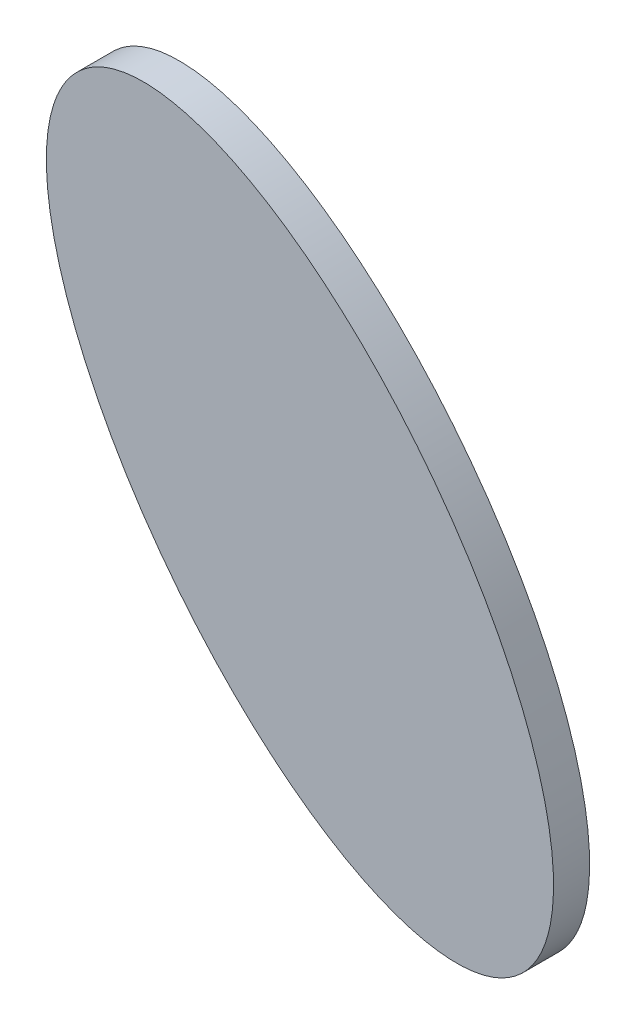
from build123d import *

# Parameters (mm, degrees)
ESQUISSE2_RX       = 791.953541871
ESQUISSE2_RY       = 375
BOSS_EXTRU_1_DEPTH = 80


with BuildPart() as part:
    # Esquisse2 → Boss.-Extru.1 (new body)
    with BuildSketch(Plane.XY):
        with Locations(Location((0, 0), (0, 0, -53.122526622))):
            Ellipse(ESQUISSE2_RX, ESQUISSE2_RY)
    extrude(amount=BOSS_EXTRU_1_DEPTH)


solid = part.part
